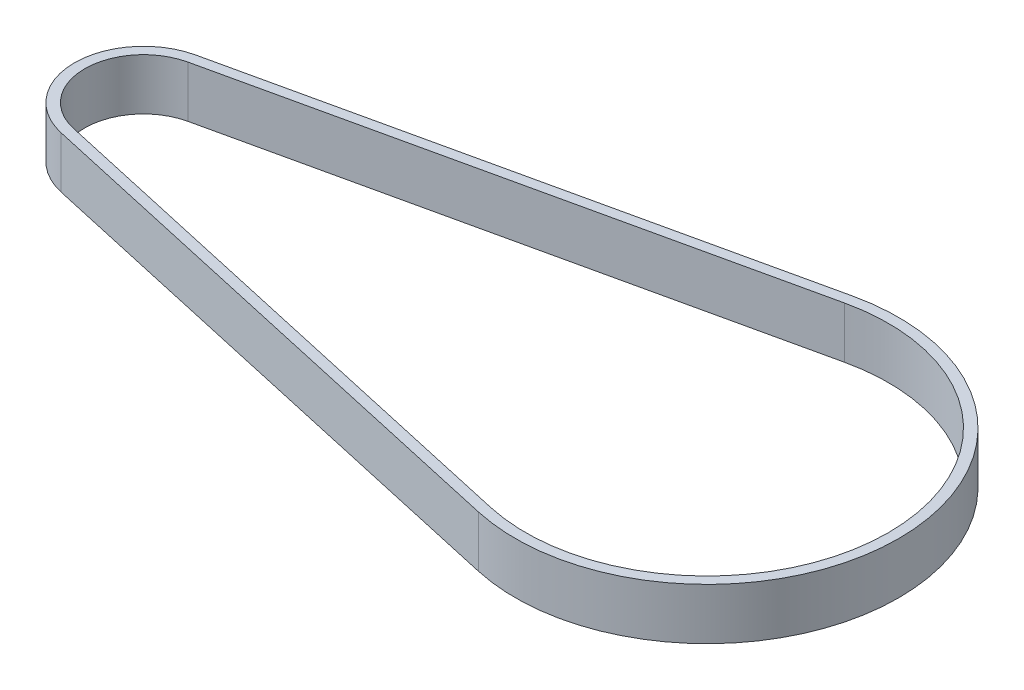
from build123d import *

# Parameters (mm, degrees)
LINEAR_AUSTRAGEN_D_NN1_DEPTH      = 2
LINEAR_AUSTRAGEN_D_NN1_DEPTH_BACK = 2


with BuildPart() as part:
    # Skizze1 → Linear-Austragen-D_nn1 (new, two sides: drawn at the far end of the back side and taken through both)
    with BuildSketch(Plane(origin=(0, 0, 0), x_dir=(1, 0, 0), z_dir=(0, 1, 0)).offset(-LINEAR_AUSTRAGEN_D_NN1_DEPTH_BACK)):
        with BuildLine():
            Line((40.65321754, -14.567567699), (-1.169276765, -5.246276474))
            ThreePointArc((-1.169276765, -5.246276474), (-5.375, 0), (-1.169276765, 5.246276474))
            Line((-1.169276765, 5.246276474), (40.65321754, 14.567567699))
            ThreePointArc((40.65321754, 14.567567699), (58.825, 0), (40.65321754, -14.567567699))
        make_face()
        with BuildLine():
            Line((40.827249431, -13.786726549), (-0.995244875, -4.465435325))
            ThreePointArc((-0.995244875, -4.465435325), (-4.575, 0), (-0.995244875, 4.465435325))
            Line((-0.995244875, 4.465435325), (40.827249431, 13.786726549))
            ThreePointArc((40.827249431, 13.786726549), (58.025, 0), (40.827249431, -13.786726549))
        make_face(mode=Mode.SUBTRACT)
    extrude(amount=LINEAR_AUSTRAGEN_D_NN1_DEPTH + LINEAR_AUSTRAGEN_D_NN1_DEPTH_BACK)


solid = part.part
